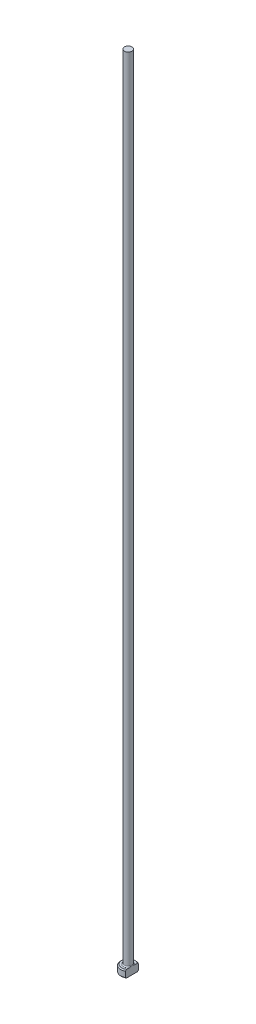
ISO-10303-21;
HEADER;
FILE_DESCRIPTION(('STEP AP214'),'2;1');
FILE_NAME('part.step','',(''),(''),'','','');
FILE_SCHEMA(('AUTOMOTIVE_DESIGN { 1 0 10303 214 1 1 1 1 }'));
ENDSEC;
DATA;
#1=APPLICATION_CONTEXT('core data for automotive mechanical design processes');
#2=APPLICATION_PROTOCOL_DEFINITION('international standard','automotive_design',2000,#1);
#3=PRODUCT_CONTEXT('',#1,'mechanical');
#4=PRODUCT('Part','Part','',(#3));
#5=PRODUCT_RELATED_PRODUCT_CATEGORY('part','',(#4));
#6=PRODUCT_DEFINITION_FORMATION('','',#4);
#7=PRODUCT_DEFINITION_CONTEXT('part definition',#1,'design');
#8=PRODUCT_DEFINITION('design','',#6,#7);
#9=PRODUCT_DEFINITION_SHAPE('','',#8);
#10=(LENGTH_UNIT() NAMED_UNIT(*) SI_UNIT(.MILLI.,.METRE.));
#11=(NAMED_UNIT(*) PLANE_ANGLE_UNIT() SI_UNIT($,.RADIAN.));
#12=(NAMED_UNIT(*) SI_UNIT($,.STERADIAN.) SOLID_ANGLE_UNIT());
#13=UNCERTAINTY_MEASURE_WITH_UNIT(LENGTH_MEASURE(1.E-05),#10,'distance_accuracy_value','');
#14=(GEOMETRIC_REPRESENTATION_CONTEXT(3) GLOBAL_UNCERTAINTY_ASSIGNED_CONTEXT((#13)) GLOBAL_UNIT_ASSIGNED_CONTEXT((#10,
#11,#12)) REPRESENTATION_CONTEXT('',''));
#15=CARTESIAN_POINT('',(0.,0.,0.));
#16=DIRECTION('',(0.,0.,1.));
#17=DIRECTION('',(1.,0.,0.));
#18=AXIS2_PLACEMENT_3D('',#15,#16,#17);
#19=CARTESIAN_POINT('',(0.,0.,0.));
#20=DIRECTION('',(0.,-1.,0.));
#21=DIRECTION('',(0.,0.,-1.));
#22=AXIS2_PLACEMENT_3D('',#19,#20,#21);
#23=PLANE('',#22);
#24=CARTESIAN_POINT('',(0.,0.,0.));
#25=DIRECTION('',(0.,-1.,0.));
#26=DIRECTION('',(0.,0.,-1.));
#27=AXIS2_PLACEMENT_3D('',#24,#25,#26);
#28=CIRCLE('',#27,1.29999999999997);
#29=CARTESIAN_POINT('',(0.749999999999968,0.,1.06183802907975));
#30=VERTEX_POINT('',#29);
#31=CARTESIAN_POINT('',(0.749999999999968,0.,-1.06183802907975));
#32=VERTEX_POINT('',#31);
#33=EDGE_CURVE('E98',#30,#32,#28,.T.);
#34=ORIENTED_EDGE('',*,*,#33,.T.);
#35=DIRECTION('',(0.,0.,1.));
#36=VECTOR('',#35,1.);
#37=CARTESIAN_POINT('',(0.749999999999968,0.,-1.29903810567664));
#38=LINE('',#37,#36);
#39=EDGE_CURVE('E83',#32,#30,#38,.T.);
#40=ORIENTED_EDGE('',*,*,#39,.T.);
#41=EDGE_LOOP('',(#34,#40));
#42=FACE_BOUND('',#41,.T.);
#43=ADVANCED_FACE('F32',(#42),#23,.T.);
#44=CARTESIAN_POINT('',(0.,259.958771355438,0.));
#45=DIRECTION('',(0.,1.,0.));
#46=DIRECTION('',(0.,0.,1.));
#47=AXIS2_PLACEMENT_3D('',#44,#45,#46);
#48=CYLINDRICAL_SURFACE('',#47,1.49999999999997);
#49=CARTESIAN_POINT('',(0.,1.30000000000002,0.));
#50=DIRECTION('',(0.,1.,0.));
#51=DIRECTION('',(0.,0.,1.));
#52=AXIS2_PLACEMENT_3D('',#49,#50,#51);
#53=CIRCLE('',#52,1.49999999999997);
#54=CARTESIAN_POINT('',(0.749999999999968,1.30000000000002,1.29903810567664));
#55=VERTEX_POINT('',#54);
#56=CARTESIAN_POINT('',(0.749999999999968,1.30000000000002,-1.29903810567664));
#57=VERTEX_POINT('',#56);
#58=EDGE_CURVE('E104',#55,#57,#53,.F.);
#59=ORIENTED_EDGE('',*,*,#58,.T.);
#60=DIRECTION('',(0.,-1.,0.));
#61=VECTOR('',#60,1.);
#62=CARTESIAN_POINT('',(0.749999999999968,160.,-1.29903810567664));
#63=LINE('',#62,#61);
#64=CARTESIAN_POINT('',(0.749999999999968,0.200000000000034,-1.29903810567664));
#65=VERTEX_POINT('',#64);
#66=EDGE_CURVE('E183',#57,#65,#63,.T.);
#67=ORIENTED_EDGE('',*,*,#66,.T.);
#68=CARTESIAN_POINT('',(0.,0.200000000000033,0.));
#69=DIRECTION('',(0.,-1.,0.));
#70=DIRECTION('',(0.,0.,-1.));
#71=AXIS2_PLACEMENT_3D('',#68,#69,#70);
#72=CIRCLE('',#71,1.49999999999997);
#73=CARTESIAN_POINT('',(0.749999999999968,0.200000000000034,1.29903810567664));
#74=VERTEX_POINT('',#73);
#75=EDGE_CURVE('E100',#65,#74,#72,.F.);
#76=ORIENTED_EDGE('',*,*,#75,.T.);
#77=DIRECTION('',(0.,-1.,0.));
#78=VECTOR('',#77,1.);
#79=CARTESIAN_POINT('',(0.749999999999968,160.,1.29903810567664));
#80=LINE('',#79,#78);
#81=EDGE_CURVE('E93',#55,#74,#80,.T.);
#82=ORIENTED_EDGE('',*,*,#81,.F.);
#83=EDGE_LOOP('',(#59,#67,#76,#82));
#84=FACE_BOUND('',#83,.T.);
#85=ADVANCED_FACE('F158',(#84),#48,.T.);
#86=CARTESIAN_POINT('',(-1.49999999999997,1.5,0.));
#87=DIRECTION('',(0.,1.,0.));
#88=DIRECTION('',(0.,0.,1.));
#89=AXIS2_PLACEMENT_3D('',#86,#87,#88);
#90=PLANE('',#89);
#91=CARTESIAN_POINT('',(0.,1.5,0.));
#92=DIRECTION('',(0.,1.,0.));
#93=DIRECTION('',(0.,0.,1.));
#94=AXIS2_PLACEMENT_3D('',#91,#92,#93);
#95=CIRCLE('',#94,1.29999999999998);
#96=CARTESIAN_POINT('',(0.749999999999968,1.5,-1.06183802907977));
#97=VERTEX_POINT('',#96);
#98=CARTESIAN_POINT('',(0.749999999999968,1.5,1.06183802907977));
#99=VERTEX_POINT('',#98);
#100=EDGE_CURVE('E178',#97,#99,#95,.T.);
#101=ORIENTED_EDGE('',*,*,#100,.T.);
#102=DIRECTION('',(0.,0.,-1.));
#103=VECTOR('',#102,1.);
#104=CARTESIAN_POINT('',(0.749999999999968,1.5,0.));
#105=LINE('',#104,#103);
#106=CARTESIAN_POINT('',(0.749999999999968,1.49999999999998,0.583095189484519));
#107=VERTEX_POINT('',#106);
#108=EDGE_CURVE('E57',#99,#107,#105,.T.);
#109=ORIENTED_EDGE('',*,*,#108,.T.);
#110=CARTESIAN_POINT('',(0.,1.5,0.));
#111=DIRECTION('',(0.,1.,0.));
#112=DIRECTION('',(0.,0.,1.));
#113=AXIS2_PLACEMENT_3D('',#110,#111,#112);
#114=CIRCLE('',#113,0.949999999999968);
#115=CARTESIAN_POINT('',(0.749999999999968,1.49999999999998,-0.583095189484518));
#116=VERTEX_POINT('',#115);
#117=EDGE_CURVE('E107',#107,#116,#114,.F.);
#118=ORIENTED_EDGE('',*,*,#117,.T.);
#119=EDGE_CURVE('E136',#116,#97,#105,.T.);
#120=ORIENTED_EDGE('',*,*,#119,.T.);
#121=EDGE_LOOP('',(#101,#109,#118,#120));
#122=FACE_BOUND('',#121,.T.);
#123=ADVANCED_FACE('F147',(#122),#90,.T.);
#124=CARTESIAN_POINT('',(0.,1.5,0.));
#125=DIRECTION('',(0.,-1.,0.));
#126=DIRECTION('',(0.,0.,-1.));
#127=AXIS2_PLACEMENT_3D('',#124,#125,#126);
#128=CONICAL_SURFACE('',#127,1.29999999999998,0.785398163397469);
#129=ORIENTED_EDGE('',*,*,#58,.F.);
#130=CARTESIAN_POINT('',(0.749999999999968,-0.159311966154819,2.86269581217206));
#131=CARTESIAN_POINT('',(0.749999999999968,-0.0964328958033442,2.79769204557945));
#132=CARTESIAN_POINT('',(0.749999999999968,-0.0336221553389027,2.73262201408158));
#133=CARTESIAN_POINT('',(0.749999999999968,0.0918244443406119,2.60231208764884));
#134=CARTESIAN_POINT('',(0.749999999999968,0.154460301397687,2.53707219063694));
#135=CARTESIAN_POINT('',(0.749999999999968,0.342109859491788,2.34097725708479));
#136=CARTESIAN_POINT('',(0.749999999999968,0.466801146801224,2.20981339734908));
#137=CARTESIAN_POINT('',(0.749999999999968,0.71232849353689,1.94880342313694));
#138=CARTESIAN_POINT('',(0.749999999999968,0.833191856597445,1.81898315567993));
#139=CARTESIAN_POINT('',(0.749999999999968,1.01264761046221,1.62259577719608));
#140=CARTESIAN_POINT('',(0.749999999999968,1.07215326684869,1.55686440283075));
#141=CARTESIAN_POINT('',(0.749999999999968,1.19029260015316,1.42462307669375));
#142=CARTESIAN_POINT('',(0.749999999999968,1.24892630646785,1.35811315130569));
#143=CARTESIAN_POINT('',(0.749999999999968,1.34237202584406,1.25003987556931));
#144=CARTESIAN_POINT('',(0.749999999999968,1.37758720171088,1.20882554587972));
#145=CARTESIAN_POINT('',(0.749999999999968,1.44738925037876,1.12585980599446));
#146=CARTESIAN_POINT('',(0.749999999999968,1.481976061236,1.08410834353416));
#147=CARTESIAN_POINT('',(0.749999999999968,1.55066668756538,0.999475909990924));
#148=CARTESIAN_POINT('',(0.749999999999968,1.58476158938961,0.956587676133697));
#149=CARTESIAN_POINT('',(0.749999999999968,1.65176028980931,0.869892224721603));
#150=CARTESIAN_POINT('',(0.749999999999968,1.6846642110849,0.826085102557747));
#151=CARTESIAN_POINT('',(0.749999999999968,1.74926316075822,0.736563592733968));
#152=CARTESIAN_POINT('',(0.749999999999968,1.78093229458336,0.690830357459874));
#153=CARTESIAN_POINT('',(0.749999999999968,1.84170221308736,0.597569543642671));
#154=CARTESIAN_POINT('',(0.749999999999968,1.87079946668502,0.550039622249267));
#155=CARTESIAN_POINT('',(0.749999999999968,1.9245841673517,0.45327502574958));
#156=CARTESIAN_POINT('',(0.749999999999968,1.94932190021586,0.404068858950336));
#157=CARTESIAN_POINT('',(0.749999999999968,1.9924017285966,0.302953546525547));
#158=CARTESIAN_POINT('',(0.749999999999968,2.01076529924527,0.251054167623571));
#159=CARTESIAN_POINT('',(0.749999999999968,2.03062801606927,0.173219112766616));
#160=CARTESIAN_POINT('',(0.749999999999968,2.03589389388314,0.148243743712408));
#161=CARTESIAN_POINT('',(0.749999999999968,2.04404463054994,0.0979002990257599));
#162=CARTESIAN_POINT('',(0.749999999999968,2.04692969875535,0.0725322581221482));
#163=CARTESIAN_POINT('',(0.749999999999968,2.05011277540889,0.0217085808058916));
#164=CARTESIAN_POINT('',(0.749999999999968,2.05041870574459,-0.00374654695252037));
#165=CARTESIAN_POINT('',(0.749999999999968,2.04844884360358,-0.0545512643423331));
#166=CARTESIAN_POINT('',(0.749999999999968,2.046172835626,-0.0799008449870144));
#167=CARTESIAN_POINT('',(0.749999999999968,2.03574038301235,-0.154989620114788));
#168=CARTESIAN_POINT('',(0.749999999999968,2.02400532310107,-0.204255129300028));
#169=CARTESIAN_POINT('',(0.749999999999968,2.00101199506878,-0.276434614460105));
#170=CARTESIAN_POINT('',(0.749999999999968,1.99241146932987,-0.3002842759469));
#171=CARTESIAN_POINT('',(0.749999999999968,1.97373056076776,-0.347397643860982));
#172=CARTESIAN_POINT('',(0.749999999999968,1.96365048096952,-0.370661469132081));
#173=CARTESIAN_POINT('',(0.749999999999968,1.93147369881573,-0.43991644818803));
#174=CARTESIAN_POINT('',(0.749999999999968,1.90754987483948,-0.485052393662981));
#175=CARTESIAN_POINT('',(0.749999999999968,1.856538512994,-0.57351807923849));
#176=CARTESIAN_POINT('',(0.749999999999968,1.82944709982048,-0.616845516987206));
#177=CARTESIAN_POINT('',(0.749999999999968,1.7730528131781,-0.70224758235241));
#178=CARTESIAN_POINT('',(0.749999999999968,1.74374234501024,-0.744317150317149));
#179=CARTESIAN_POINT('',(0.749999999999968,1.68364081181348,-0.82739018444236));
#180=CARTESIAN_POINT('',(0.749999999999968,1.65284939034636,-0.868393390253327));
#181=CARTESIAN_POINT('',(0.749999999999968,1.55811585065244,-0.991236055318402));
#182=CARTESIAN_POINT('',(0.749999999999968,1.49256261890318,-1.07182756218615));
#183=CARTESIAN_POINT('',(0.749999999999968,1.35929153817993,-1.23084604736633));
#184=CARTESIAN_POINT('',(0.749999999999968,1.29157909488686,-1.30927763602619));
#185=CARTESIAN_POINT('',(0.749999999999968,1.16634991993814,-1.4516373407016));
#186=CARTESIAN_POINT('',(0.749999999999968,1.10905780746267,-1.51576342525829));
#187=CARTESIAN_POINT('',(0.749999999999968,0.993771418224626,-1.64338257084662));
#188=CARTESIAN_POINT('',(0.749999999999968,0.935777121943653,-1.70687561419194));
#189=CARTESIAN_POINT('',(0.749999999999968,0.760930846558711,-1.8967787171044));
#190=CARTESIAN_POINT('',(0.749999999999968,0.6433230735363,-2.02249209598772));
#191=CARTESIAN_POINT('',(0.749999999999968,0.411828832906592,-2.26768837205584));
#192=CARTESIAN_POINT('',(0.749999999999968,0.29798827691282,-2.38721485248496));
#193=CARTESIAN_POINT('',(0.749999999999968,0.0697231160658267,-2.62545352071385));
#194=CARTESIAN_POINT('',(0.749999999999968,-0.0447006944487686,-2.74416646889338));
#195=CARTESIAN_POINT('',(0.749999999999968,-0.159311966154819,-2.86269581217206));
#196=B_SPLINE_CURVE_WITH_KNOTS('',3,(#130,#131,#132,#133,#134,#135,#136,#137,#138,#139,#140,
#141,#142,#143,#144,#145,#146,#147,#148,#149,#150,#151,#152,#153,#154,#155,#156,#157,#158,#159,
#160,#161,#162,#163,#164,#165,#166,#167,#168,#169,#170,#171,#172,#173,#174,#175,#176,#177,#178,
#179,#180,#181,#182,#183,#184,#185,#186,#187,#188,#189,#190,#191,#192,#193,#194,#195),
.UNSPECIFIED.,.F.,.F.,(4,2,2,2,2,2,2,2,2,2,2,2,2,2,2,2,2,2,2,2,2,2,2,2,2,2,2,2,2,2,2,2,4),(0.,
0.271318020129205,0.542639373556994,1.08555961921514,1.61765797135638,1.8836492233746,
2.14963148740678,2.31225703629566,2.47489853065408,2.63925165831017,2.80358780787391,
2.97041571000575,3.13746921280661,3.30244771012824,3.46686485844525,3.54334114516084,
3.61981070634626,3.6960453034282,3.77228626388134,3.92333298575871,3.9993629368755,
4.07537733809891,4.22841106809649,4.38163402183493,4.53540740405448,4.68921798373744,
5.00077730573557,5.31160990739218,5.56957672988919,5.82755073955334,6.34398366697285,
6.83917444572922,7.33381214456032),.UNSPECIFIED.);
#197=EDGE_CURVE('E135',#55,#99,#196,.T.);
#198=ORIENTED_EDGE('',*,*,#197,.T.);
#199=ORIENTED_EDGE('',*,*,#100,.F.);
#200=EDGE_CURVE('E127',#97,#57,#196,.T.);
#201=ORIENTED_EDGE('',*,*,#200,.T.);
#202=EDGE_LOOP('',(#129,#198,#199,#201));
#203=FACE_BOUND('',#202,.T.);
#204=ADVANCED_FACE('F143',(#203),#128,.T.);
#205=CARTESIAN_POINT('',(0.,0.200000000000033,0.));
#206=DIRECTION('',(0.,1.,0.));
#207=DIRECTION('',(0.,0.,1.));
#208=AXIS2_PLACEMENT_3D('',#205,#206,#207);
#209=CONICAL_SURFACE('',#208,1.49999999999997,0.785398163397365);
#210=ORIENTED_EDGE('',*,*,#75,.F.);
#211=CARTESIAN_POINT('',(0.749999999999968,1.65931196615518,-2.86269581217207));
#212=CARTESIAN_POINT('',(0.749999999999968,1.59643289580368,-2.79769204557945));
#213=CARTESIAN_POINT('',(0.749999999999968,1.53362215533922,-2.73262201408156));
#214=CARTESIAN_POINT('',(0.749999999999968,1.40817555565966,-2.60231208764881));
#215=CARTESIAN_POINT('',(0.749999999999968,1.34553969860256,-2.53707219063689));
#216=CARTESIAN_POINT('',(0.749999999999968,1.15789014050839,-2.34097725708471));
#217=CARTESIAN_POINT('',(0.749999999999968,1.03319885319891,-2.20981339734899));
#218=CARTESIAN_POINT('',(0.749999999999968,0.787671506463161,-1.9488034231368));
#219=CARTESIAN_POINT('',(0.749999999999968,0.666808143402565,-1.81898315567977));
#220=CARTESIAN_POINT('',(0.749999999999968,0.487352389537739,-1.6225957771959));
#221=CARTESIAN_POINT('',(0.749999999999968,0.427846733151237,-1.55686440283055));
#222=CARTESIAN_POINT('',(0.749999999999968,0.309707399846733,-1.42462307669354));
#223=CARTESIAN_POINT('',(0.749999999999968,0.251073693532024,-1.35811315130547));
#224=CARTESIAN_POINT('',(0.749999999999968,0.157627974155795,-1.25003987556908));
#225=CARTESIAN_POINT('',(0.749999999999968,0.122412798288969,-1.2088255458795));
#226=CARTESIAN_POINT('',(0.749999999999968,0.0526107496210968,-1.12585980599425));
#227=CARTESIAN_POINT('',(0.749999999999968,0.0180239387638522,-1.08410834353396));
#228=CARTESIAN_POINT('',(0.749999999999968,-0.0506666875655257,-0.999475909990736));
#229=CARTESIAN_POINT('',(0.749999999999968,-0.0847615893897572,-0.956587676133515));
#230=CARTESIAN_POINT('',(0.749999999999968,-0.151760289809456,-0.869892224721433));
#231=CARTESIAN_POINT('',(0.749999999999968,-0.184664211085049,-0.826085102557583));
#232=CARTESIAN_POINT('',(0.749999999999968,-0.249263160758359,-0.736563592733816));
#233=CARTESIAN_POINT('',(0.749999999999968,-0.280932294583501,-0.690830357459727));
#234=CARTESIAN_POINT('',(0.749999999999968,-0.3417022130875,-0.597569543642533));
#235=CARTESIAN_POINT('',(0.749999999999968,-0.370799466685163,-0.550039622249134));
#236=CARTESIAN_POINT('',(0.749999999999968,-0.424584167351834,-0.453275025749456));
#237=CARTESIAN_POINT('',(0.749999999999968,-0.449321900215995,-0.404068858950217));
#238=CARTESIAN_POINT('',(0.749999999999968,-0.492401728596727,-0.302953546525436));
#239=CARTESIAN_POINT('',(0.749999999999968,-0.510765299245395,-0.251054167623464));
#240=CARTESIAN_POINT('',(0.749999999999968,-0.530628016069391,-0.173219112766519));
#241=CARTESIAN_POINT('',(0.749999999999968,-0.535893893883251,-0.148243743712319));
#242=CARTESIAN_POINT('',(0.749999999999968,-0.544044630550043,-0.0979002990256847));
#243=CARTESIAN_POINT('',(0.749999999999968,-0.546929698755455,-0.07253225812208));
#244=CARTESIAN_POINT('',(0.749999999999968,-0.550112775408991,-0.0217085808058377));
#245=CARTESIAN_POINT('',(0.749999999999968,-0.550418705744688,0.0037465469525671));
#246=CARTESIAN_POINT('',(0.749999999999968,-0.54844884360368,0.0545512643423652));
#247=CARTESIAN_POINT('',(0.749999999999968,-0.546172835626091,0.0799008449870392));
#248=CARTESIAN_POINT('',(0.749999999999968,-0.535740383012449,0.15498962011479));
#249=CARTESIAN_POINT('',(0.749999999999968,-0.524005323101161,0.204255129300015));
#250=CARTESIAN_POINT('',(0.749999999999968,-0.50101199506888,0.276434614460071));
#251=CARTESIAN_POINT('',(0.749999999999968,-0.49241146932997,0.300284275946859));
#252=CARTESIAN_POINT('',(0.749999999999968,-0.473730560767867,0.347397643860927));
#253=CARTESIAN_POINT('',(0.749999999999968,-0.463650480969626,0.370661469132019));
#254=CARTESIAN_POINT('',(0.749999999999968,-0.431473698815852,0.439916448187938));
#255=CARTESIAN_POINT('',(0.749999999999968,-0.407549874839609,0.485052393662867));
#256=CARTESIAN_POINT('',(0.749999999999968,-0.356538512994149,0.573518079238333));
#257=CARTESIAN_POINT('',(0.749999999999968,-0.329447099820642,0.616845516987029));
#258=CARTESIAN_POINT('',(0.749999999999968,-0.273052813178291,0.702247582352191));
#259=CARTESIAN_POINT('',(0.749999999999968,-0.243742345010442,0.744317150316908));
#260=CARTESIAN_POINT('',(0.749999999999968,-0.183640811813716,0.827390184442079));
#261=CARTESIAN_POINT('',(0.749999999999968,-0.152849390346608,0.868393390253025));
#262=CARTESIAN_POINT('',(0.749999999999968,-0.0581158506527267,0.99123605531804));
#263=CARTESIAN_POINT('',(0.749999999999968,0.00743738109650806,1.07182756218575));
#264=CARTESIAN_POINT('',(0.749999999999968,0.140708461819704,1.23084604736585));
#265=CARTESIAN_POINT('',(0.749999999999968,0.208420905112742,1.30927763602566));
#266=CARTESIAN_POINT('',(0.749999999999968,0.333650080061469,1.45163734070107));
#267=CARTESIAN_POINT('',(0.749999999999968,0.390942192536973,1.51576342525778));
#268=CARTESIAN_POINT('',(0.749999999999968,0.506228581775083,1.64338257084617));
#269=CARTESIAN_POINT('',(0.749999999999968,0.56422287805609,1.70687561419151));
#270=CARTESIAN_POINT('',(0.749999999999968,0.739069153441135,1.89677871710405));
#271=CARTESIAN_POINT('',(0.749999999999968,0.856676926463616,2.02249209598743));
#272=CARTESIAN_POINT('',(0.749999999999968,1.08817116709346,2.26768837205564));
#273=CARTESIAN_POINT('',(0.749999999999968,1.20201172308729,2.3872148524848));
#274=CARTESIAN_POINT('',(0.749999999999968,1.43027688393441,2.62545352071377));
#275=CARTESIAN_POINT('',(0.749999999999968,1.54470069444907,2.74416646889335));
#276=CARTESIAN_POINT('',(0.749999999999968,1.65931196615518,2.86269581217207));
#277=B_SPLINE_CURVE_WITH_KNOTS('',3,(#211,#212,#213,#214,#215,#216,#217,#218,#219,#220,#221,
#222,#223,#224,#225,#226,#227,#228,#229,#230,#231,#232,#233,#234,#235,#236,#237,#238,#239,#240,
#241,#242,#243,#244,#245,#246,#247,#248,#249,#250,#251,#252,#253,#254,#255,#256,#257,#258,#259,
#260,#261,#262,#263,#264,#265,#266,#267,#268,#269,#270,#271,#272,#273,#274,#275,#276),
.UNSPECIFIED.,.F.,.F.,(4,2,2,2,2,2,2,2,2,2,2,2,2,2,2,2,2,2,2,2,2,2,2,2,2,2,2,2,2,2,2,2,4),(0.,
0.271318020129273,0.542639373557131,1.08555961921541,1.61765797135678,1.88364922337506,
2.1496314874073,2.31225703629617,2.47489853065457,2.63925165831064,2.80358780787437,
2.9704157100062,3.13746921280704,3.30244771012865,3.46686485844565,3.54334114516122,
3.61981070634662,3.69604530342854,3.77228626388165,3.92333298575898,3.99936293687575,
4.07537733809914,4.22841106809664,4.38163402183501,4.53540740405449,4.68921798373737,
5.00077730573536,5.31160990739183,5.56957672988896,5.82755073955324,6.34398366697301,
6.83917444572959,7.33381214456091),.UNSPECIFIED.);
#278=EDGE_CURVE('E86',#65,#32,#277,.T.);
#279=ORIENTED_EDGE('',*,*,#278,.T.);
#280=ORIENTED_EDGE('',*,*,#33,.F.);
#281=EDGE_CURVE('E89',#30,#74,#277,.T.);
#282=ORIENTED_EDGE('',*,*,#281,.T.);
#283=EDGE_LOOP('',(#210,#279,#280,#282));
#284=FACE_BOUND('',#283,.T.);
#285=ADVANCED_FACE('F97',(#284),#209,.T.);
#286=CARTESIAN_POINT('',(0.,1.69999999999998,0.));
#287=DIRECTION('',(0.,1.,0.));
#288=DIRECTION('',(0.,0.,1.));
#289=AXIS2_PLACEMENT_3D('',#286,#287,#288);
#290=TOROIDAL_SURFACE('',#289,0.949999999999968,0.2);
#291=CARTESIAN_POINT('',(0.749999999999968,1.69999999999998,0.));
#292=CARTESIAN_POINT('',(0.749999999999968,1.70000052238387,0.));
#293=CARTESIAN_POINT('',(0.749999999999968,1.70000104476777,-7.92518426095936E-08));
#294=CARTESIAN_POINT('',(0.749999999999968,1.70000206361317,-3.45345029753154E-07));
#295=CARTESIAN_POINT('',(0.749999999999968,1.70000255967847,-5.3349315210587E-07));
#296=CARTESIAN_POINT('',(0.749999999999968,1.70000354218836,-9.91557921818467E-07));
#297=CARTESIAN_POINT('',(0.749999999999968,1.70000402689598,-1.26510931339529E-06));
#298=CARTESIAN_POINT('',(0.749999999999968,1.70000495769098,-1.86638896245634E-06));
#299=CARTESIAN_POINT('',(0.749999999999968,1.70000540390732,-2.19392466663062E-06));
#300=CARTESIAN_POINT('',(0.749999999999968,1.70000683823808,-3.33370952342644E-06));
#301=CARTESIAN_POINT('',(0.749999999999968,1.70000776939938,-4.21820142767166E-06));
#302=CARTESIAN_POINT('',(0.749999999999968,1.70000948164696,-6.08403165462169E-06));
#303=CARTESIAN_POINT('',(0.749999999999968,1.70001026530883,-7.06314143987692E-06));
#304=CARTESIAN_POINT('',(0.749999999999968,1.70001305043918,-1.07283299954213E-05));
#305=CARTESIAN_POINT('',(0.749999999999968,1.70001489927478,-1.35334970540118E-05));
#306=CARTESIAN_POINT('',(0.749999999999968,1.70001806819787,-1.91887701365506E-05));
#307=CARTESIAN_POINT('',(0.749999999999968,1.70001941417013,-2.20250297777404E-05));
#308=CARTESIAN_POINT('',(0.749999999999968,1.700024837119,-3.36357626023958E-05));
#309=CARTESIAN_POINT('',(0.749999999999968,1.70002876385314,-4.24755661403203E-05));
#310=CARTESIAN_POINT('',(0.749999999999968,1.70003535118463,-5.93015818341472E-05));
#311=CARTESIAN_POINT('',(0.749999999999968,1.70003811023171,-6.72480836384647E-05));
#312=CARTESIAN_POINT('',(0.749999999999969,1.70005910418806,-0.000122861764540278));
#313=CARTESIAN_POINT('',(0.749999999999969,1.7000847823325,-0.000167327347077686));
#314=CARTESIAN_POINT('',(0.749999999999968,1.70017912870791,-0.000337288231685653));
#315=CARTESIAN_POINT('',(0.749999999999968,1.70024226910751,-0.000465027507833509));
#316=CARTESIAN_POINT('',(0.749999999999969,1.70048606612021,-0.000950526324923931));
#317=CARTESIAN_POINT('',(0.749999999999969,1.70067249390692,-0.00130597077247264));
#318=CARTESIAN_POINT('',(0.749999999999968,1.70141452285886,-0.00272815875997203));
#319=CARTESIAN_POINT('',(0.749999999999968,1.70196367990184,-0.00379745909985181));
#320=CARTESIAN_POINT('',(0.749999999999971,1.71079317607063,-0.0209810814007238));
#321=CARTESIAN_POINT('',(0.749999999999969,1.71912708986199,-0.0370747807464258));
#322=CARTESIAN_POINT('',(0.749999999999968,1.7353816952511,-0.068794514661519));
#323=CARTESIAN_POINT('',(0.749999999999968,1.74330692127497,-0.0844183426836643));
#324=CARTESIAN_POINT('',(0.749999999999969,1.75980152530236,-0.11741223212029));
#325=CARTESIAN_POINT('',(0.749999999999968,1.76835063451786,-0.134792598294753));
#326=CARTESIAN_POINT('',(0.749999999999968,1.7851625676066,-0.169887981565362));
#327=CARTESIAN_POINT('',(0.749999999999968,1.79342203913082,-0.187604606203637));
#328=CARTESIAN_POINT('',(0.749999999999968,1.81367684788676,-0.232718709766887));
#329=CARTESIAN_POINT('',(0.749999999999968,1.82533268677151,-0.260271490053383));
#330=CARTESIAN_POINT('',(0.749999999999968,1.84666110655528,-0.315501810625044));
#331=CARTESIAN_POINT('',(0.749999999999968,1.85636938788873,-0.34316526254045));
#332=CARTESIAN_POINT('',(0.749999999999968,1.87268127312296,-0.396748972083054));
#333=CARTESIAN_POINT('',(0.749999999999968,1.87948325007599,-0.42260763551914));
#334=CARTESIAN_POINT('',(0.749999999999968,1.89076706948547,-0.476103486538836));
#335=CARTESIAN_POINT('',(0.749999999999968,1.89512718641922,-0.50376764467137));
#336=CARTESIAN_POINT('',(0.749999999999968,1.90012258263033,-0.559350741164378));
#337=CARTESIAN_POINT('',(0.749999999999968,1.90077276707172,-0.587268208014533));
#338=CARTESIAN_POINT('',(0.749999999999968,1.8972553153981,-0.64249646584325));
#339=CARTESIAN_POINT('',(0.749999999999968,1.89315871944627,-0.669810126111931));
#340=CARTESIAN_POINT('',(0.749999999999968,1.88226759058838,-0.710376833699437));
#341=CARTESIAN_POINT('',(0.749999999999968,1.87764112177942,-0.724213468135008));
#342=CARTESIAN_POINT('',(0.749999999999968,1.8664543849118,-0.751128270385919));
#343=CARTESIAN_POINT('',(0.749999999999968,1.85989169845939,-0.764205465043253));
#344=CARTESIAN_POINT('',(0.749999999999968,1.84591711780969,-0.787020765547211));
#345=CARTESIAN_POINT('',(0.749999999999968,1.83882518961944,-0.796953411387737));
#346=CARTESIAN_POINT('',(0.749999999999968,1.82312129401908,-0.815534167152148));
#347=CARTESIAN_POINT('',(0.749999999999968,1.81451194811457,-0.824184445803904));
#348=CARTESIAN_POINT('',(0.749999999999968,1.79770708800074,-0.838172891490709));
#349=CARTESIAN_POINT('',(0.749999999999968,1.78977561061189,-0.84382734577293));
#350=CARTESIAN_POINT('',(0.749999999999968,1.77308433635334,-0.853755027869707));
#351=CARTESIAN_POINT('',(0.749999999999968,1.76432487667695,-0.858028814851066));
#352=CARTESIAN_POINT('',(0.749999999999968,1.74611994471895,-0.864966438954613));
#353=CARTESIAN_POINT('',(0.749999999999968,1.73667052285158,-0.867620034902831));
#354=CARTESIAN_POINT('',(0.749999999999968,1.71743927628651,-0.871086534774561));
#355=CARTESIAN_POINT('',(0.749999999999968,1.70765762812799,-0.871900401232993));
#356=CARTESIAN_POINT('',(0.749999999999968,1.68916476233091,-0.871644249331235));
#357=CARTESIAN_POINT('',(0.749999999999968,1.68045031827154,-0.870765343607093));
#358=CARTESIAN_POINT('',(0.749999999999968,1.66329782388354,-0.867547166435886));
#359=CARTESIAN_POINT('',(0.749999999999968,1.65485975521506,-0.865207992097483));
#360=CARTESIAN_POINT('',(0.749999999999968,1.63851016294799,-0.859212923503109));
#361=CARTESIAN_POINT('',(0.749999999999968,1.63059660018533,-0.855562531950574));
#362=CARTESIAN_POINT('',(0.749999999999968,1.61540880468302,-0.847119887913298));
#363=CARTESIAN_POINT('',(0.749999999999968,1.60813470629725,-0.842327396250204));
#364=CARTESIAN_POINT('',(0.749999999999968,1.59350795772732,-0.831172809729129));
#365=CARTESIAN_POINT('',(0.749999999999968,1.58624574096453,-0.82469266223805));
#366=CARTESIAN_POINT('',(0.749999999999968,1.57268239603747,-0.810794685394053));
#367=CARTESIAN_POINT('',(0.749999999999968,1.56638225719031,-0.803375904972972));
#368=CARTESIAN_POINT('',(0.749999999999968,1.55147186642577,-0.783446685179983));
#369=CARTESIAN_POINT('',(0.749999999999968,1.54355238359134,-0.770417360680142));
#370=CARTESIAN_POINT('',(0.749999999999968,1.52991429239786,-0.743286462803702));
#371=CARTESIAN_POINT('',(0.749999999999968,1.52419651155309,-0.729184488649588));
#372=CARTESIAN_POINT('',(0.749999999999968,1.51257018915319,-0.693822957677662));
#373=CARTESIAN_POINT('',(0.749999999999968,1.50774380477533,-0.672209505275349));
#374=CARTESIAN_POINT('',(0.749999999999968,1.50145191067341,-0.628298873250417));
#375=CARTESIAN_POINT('',(0.749999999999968,1.5000267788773,-0.605996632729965));
#376=CARTESIAN_POINT('',(0.749999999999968,1.49995578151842,-0.546111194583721));
#377=CARTESIAN_POINT('',(0.749999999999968,1.50388309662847,-0.508527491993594));
#378=CARTESIAN_POINT('',(0.749999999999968,1.51373246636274,-0.453837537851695));
#379=CARTESIAN_POINT('',(0.749999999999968,1.51754666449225,-0.436272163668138));
#380=CARTESIAN_POINT('',(0.749999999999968,1.52621031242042,-0.401484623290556));
#381=CARTESIAN_POINT('',(0.749999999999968,1.53105449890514,-0.384261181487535));
#382=CARTESIAN_POINT('',(0.749999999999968,1.54486296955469,-0.339542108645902));
#383=CARTESIAN_POINT('',(0.749999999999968,1.55452531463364,-0.312264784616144));
#384=CARTESIAN_POINT('',(0.749999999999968,1.57570310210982,-0.257776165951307));
#385=CARTESIAN_POINT('',(0.749999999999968,1.58725400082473,-0.230578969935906));
#386=CARTESIAN_POINT('',(0.749999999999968,1.60733071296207,-0.18597536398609));
#387=CARTESIAN_POINT('',(0.749999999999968,1.6155301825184,-0.168419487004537));
#388=CARTESIAN_POINT('',(0.749999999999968,1.63221303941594,-0.133639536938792));
#389=CARTESIAN_POINT('',(0.749999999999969,1.64069316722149,-0.116413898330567));
#390=CARTESIAN_POINT('',(0.749999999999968,1.65705001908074,-0.0837133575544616));
#391=CARTESIAN_POINT('',(0.749999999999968,1.66490699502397,-0.0682284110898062));
#392=CARTESIAN_POINT('',(0.749999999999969,1.68101978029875,-0.0367899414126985));
#393=CARTESIAN_POINT('',(0.749999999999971,1.68928002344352,-0.0208385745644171));
#394=CARTESIAN_POINT('',(0.749999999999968,1.69803632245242,-0.00379745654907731));
#395=CARTESIAN_POINT('',(0.749999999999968,1.69858548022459,-0.00272815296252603));
#396=CARTESIAN_POINT('',(0.749999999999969,1.69932750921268,-0.00130596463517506));
#397=CARTESIAN_POINT('',(0.749999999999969,1.69951393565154,-0.000950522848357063));
#398=CARTESIAN_POINT('',(0.749999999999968,1.69975773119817,-0.000465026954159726));
#399=CARTESIAN_POINT('',(0.749999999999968,1.6998208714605,-0.000337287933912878));
#400=CARTESIAN_POINT('',(0.749999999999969,1.69991521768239,-0.00016732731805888));
#401=CARTESIAN_POINT('',(0.749999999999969,1.69994089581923,-0.000122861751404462));
#402=CARTESIAN_POINT('',(0.749999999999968,1.69996188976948,-6.72480869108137E-05));
#403=CARTESIAN_POINT('',(0.749999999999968,1.69996464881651,-5.93015849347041E-05));
#404=CARTESIAN_POINT('',(0.749999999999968,1.6999712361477,-4.24755687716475E-05));
#405=CARTESIAN_POINT('',(0.749999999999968,1.69997516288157,-3.36357649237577E-05));
#406=CARTESIAN_POINT('',(0.749999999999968,1.69998058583,-2.20250315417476E-05));
#407=CARTESIAN_POINT('',(0.749999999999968,1.69998193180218,-1.91887716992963E-05));
#408=CARTESIAN_POINT('',(0.749999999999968,1.69998510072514,-1.35334981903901E-05));
#409=CARTESIAN_POINT('',(0.749999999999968,1.69998694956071,-1.07283309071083E-05));
#410=CARTESIAN_POINT('',(0.749999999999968,1.69998973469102,-7.06314205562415E-06));
#411=CARTESIAN_POINT('',(0.749999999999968,1.69999051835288,-6.08403219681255E-06));
#412=CARTESIAN_POINT('',(0.749999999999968,1.69999223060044,-4.21820182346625E-06));
#413=CARTESIAN_POINT('',(0.749999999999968,1.69999316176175,-3.33370984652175E-06));
#414=CARTESIAN_POINT('',(0.749999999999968,1.69999459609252,-2.19392489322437E-06));
#415=CARTESIAN_POINT('',(0.749999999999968,1.69999504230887,-1.86638916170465E-06));
#416=CARTESIAN_POINT('',(0.749999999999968,1.69999597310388,-1.26510946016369E-06));
#417=CARTESIAN_POINT('',(0.749999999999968,1.69999645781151,-9.91558043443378E-07));
#418=CARTESIAN_POINT('',(0.749999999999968,1.69999744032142,-5.33493228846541E-07));
#419=CARTESIAN_POINT('',(0.749999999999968,1.69999793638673,-3.453450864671E-07));
#420=CARTESIAN_POINT('',(0.749999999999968,1.69999895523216,-7.92518654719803E-08));
#421=CARTESIAN_POINT('',(0.749999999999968,1.69999947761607,0.));
#422=CARTESIAN_POINT('',(0.749999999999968,1.69999999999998,0.));
#423=B_SPLINE_CURVE_WITH_KNOTS('',3,(#291,#292,#293,#294,#295,#296,#297,#298,#299,#300,#301,
#302,#303,#304,#305,#306,#307,#308,#309,#310,#311,#312,#313,#314,#315,#316,#317,#318,#319,#320,
#321,#322,#323,#324,#325,#326,#327,#328,#329,#330,#331,#332,#333,#334,#335,#336,#337,#338,#339,
#340,#341,#342,#343,#344,#345,#346,#347,#348,#349,#350,#351,#352,#353,#354,#355,#356,#357,#358,
#359,#360,#361,#362,#363,#364,#365,#366,#367,#368,#369,#370,#371,#372,#373,#374,#375,#376,#377,
#378,#379,#380,#381,#382,#383,#384,#385,#386,#387,#388,#389,#390,#391,#392,#393,#394,#395,#396,
#397,#398,#399,#400,#401,#402,#403,#404,#405,#406,#407,#408,#409,#410,#411,#412,#413,#414,#415,
#416,#417,#418,#419,#420,#421,#422),.UNSPECIFIED.,.T.,.F.,(4,2,2,2,2,2,2,2,2,2,2,2,2,2,2,2,2,2,
2,2,2,2,2,2,2,2,2,2,2,2,2,2,2,2,2,2,2,2,2,2,2,2,2,2,2,2,2,2,2,2,2,2,2,2,2,2,2,2,2,2,2,2,2,2,2,
4),(0.,1.56543920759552E-06,3.1500654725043E-06,4.81434344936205E-06,6.47280881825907E-06,
1.03067366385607E-05,1.4065794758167E-05,2.41046688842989E-05,3.35140857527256E-05,
6.25197196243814E-05,8.77289706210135E-05,0.000240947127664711,0.000669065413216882,
0.00187238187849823,0.00547938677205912,0.0598417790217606,0.112399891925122,0.170503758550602,
0.229141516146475,0.318850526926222,0.406723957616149,0.486842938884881,0.570663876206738,
0.654147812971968,0.736398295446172,0.780052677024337,0.823761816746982,0.860241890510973,
0.896659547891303,0.925764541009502,0.954857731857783,0.98413296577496,1.01339287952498,
1.03954157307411,1.06568852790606,1.09172701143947,1.11777095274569,1.14686281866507,
1.17598440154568,1.22146737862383,1.26696743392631,1.33303548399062,1.39988404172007,
1.51253340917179,1.56644503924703,1.62008752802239,1.70682485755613,1.79543193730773,
1.85355663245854,1.91115281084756,1.96324672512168,2.01712839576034,2.02073541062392,
2.02193871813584,2.02236683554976,2.02252005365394,2.02254526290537,2.02257426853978,
2.02258367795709,2.02259371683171,2.02259747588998,2.02260130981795,2.02260296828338,
2.02260463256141,2.02260621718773,2.02260778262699),.UNSPECIFIED.);
#424=CARTESIAN_POINT('',(0.749999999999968,1.69999999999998,0.));
#425=VERTEX_POINT('',#424);
#426=EDGE_CURVE('E11',#116,#425,#423,.T.);
#427=ORIENTED_EDGE('',*,*,#426,.F.);
#428=ORIENTED_EDGE('',*,*,#117,.F.);
#429=CARTESIAN_POINT('',(0.749999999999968,1.69999999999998,0.));
#430=CARTESIAN_POINT('',(0.749999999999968,1.69999947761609,0.));
#431=CARTESIAN_POINT('',(0.749999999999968,1.69999895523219,7.92518426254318E-08));
#432=CARTESIAN_POINT('',(0.749999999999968,1.69999793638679,3.45345029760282E-07));
#433=CARTESIAN_POINT('',(0.749999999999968,1.69999744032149,5.33493152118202E-07));
#434=CARTESIAN_POINT('',(0.749999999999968,1.6999964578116,9.91557921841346E-07));
#435=CARTESIAN_POINT('',(0.749999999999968,1.69999597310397,1.26510931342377E-06));
#436=CARTESIAN_POINT('',(0.749999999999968,1.69999504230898,1.86638896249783E-06));
#437=CARTESIAN_POINT('',(0.749999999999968,1.69999459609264,2.19392466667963E-06));
#438=CARTESIAN_POINT('',(0.749999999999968,1.69999316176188,3.33370952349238E-06));
#439=CARTESIAN_POINT('',(0.749999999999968,1.69999223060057,4.21820142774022E-06));
#440=CARTESIAN_POINT('',(0.749999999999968,1.699990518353,6.08403165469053E-06));
#441=CARTESIAN_POINT('',(0.749999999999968,1.69998973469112,7.06314143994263E-06));
#442=CARTESIAN_POINT('',(0.749999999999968,1.69998694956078,1.07283299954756E-05));
#443=CARTESIAN_POINT('',(0.749999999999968,1.69998510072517,1.35334970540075E-05));
#444=CARTESIAN_POINT('',(0.749999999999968,1.69998193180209,1.91887701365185E-05));
#445=CARTESIAN_POINT('',(0.749999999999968,1.69998058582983,2.20250297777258E-05));
#446=CARTESIAN_POINT('',(0.749999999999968,1.69997516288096,3.36357626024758E-05));
#447=CARTESIAN_POINT('',(0.749999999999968,1.69997123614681,4.24755661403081E-05));
#448=CARTESIAN_POINT('',(0.749999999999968,1.69996464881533,5.93015818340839E-05));
#449=CARTESIAN_POINT('',(0.749999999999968,1.69996188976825,6.72480836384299E-05));
#450=CARTESIAN_POINT('',(0.749999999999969,1.6999408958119,0.000122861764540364));
#451=CARTESIAN_POINT('',(0.749999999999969,1.69991521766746,0.00016732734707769));
#452=CARTESIAN_POINT('',(0.749999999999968,1.69982087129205,0.000337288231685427));
#453=CARTESIAN_POINT('',(0.749999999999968,1.69975773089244,0.000465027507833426));
#454=CARTESIAN_POINT('',(0.749999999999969,1.69951393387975,0.000950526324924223));
#455=CARTESIAN_POINT('',(0.749999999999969,1.69932750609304,0.00130597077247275));
#456=CARTESIAN_POINT('',(0.749999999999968,1.6985854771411,0.00272815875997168));
#457=CARTESIAN_POINT('',(0.749999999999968,1.69803632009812,0.00379745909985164));
#458=CARTESIAN_POINT('',(0.749999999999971,1.68920682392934,0.0209810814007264));
#459=CARTESIAN_POINT('',(0.749999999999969,1.68087291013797,0.0370747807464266));
#460=CARTESIAN_POINT('',(0.749999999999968,1.66461830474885,0.0687945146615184));
#461=CARTESIAN_POINT('',(0.749999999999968,1.65669307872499,0.0844183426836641));
#462=CARTESIAN_POINT('',(0.749999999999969,1.6401984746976,0.11741223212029));
#463=CARTESIAN_POINT('',(0.749999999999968,1.6316493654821,0.134792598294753));
#464=CARTESIAN_POINT('',(0.749999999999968,1.61483743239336,0.169887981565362));
#465=CARTESIAN_POINT('',(0.749999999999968,1.60657796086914,0.187604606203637));
#466=CARTESIAN_POINT('',(0.749999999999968,1.5863231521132,0.232718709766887));
#467=CARTESIAN_POINT('',(0.749999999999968,1.57466731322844,0.260271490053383));
#468=CARTESIAN_POINT('',(0.749999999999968,1.55333889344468,0.315501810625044));
#469=CARTESIAN_POINT('',(0.749999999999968,1.54363061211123,0.34316526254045));
#470=CARTESIAN_POINT('',(0.749999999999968,1.52731872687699,0.396748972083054));
#471=CARTESIAN_POINT('',(0.749999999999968,1.52051674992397,0.42260763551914));
#472=CARTESIAN_POINT('',(0.749999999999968,1.50923293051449,0.476103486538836));
#473=CARTESIAN_POINT('',(0.749999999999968,1.50487281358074,0.50376764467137));
#474=CARTESIAN_POINT('',(0.749999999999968,1.49987741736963,0.559350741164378));
#475=CARTESIAN_POINT('',(0.749999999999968,1.49922723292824,0.587268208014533));
#476=CARTESIAN_POINT('',(0.749999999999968,1.50274468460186,0.64249646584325));
#477=CARTESIAN_POINT('',(0.749999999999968,1.50684128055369,0.669810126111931));
#478=CARTESIAN_POINT('',(0.749999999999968,1.51773240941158,0.710376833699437));
#479=CARTESIAN_POINT('',(0.749999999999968,1.52235887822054,0.724213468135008));
#480=CARTESIAN_POINT('',(0.749999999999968,1.53354561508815,0.751128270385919));
#481=CARTESIAN_POINT('',(0.749999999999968,1.54010830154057,0.764205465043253));
#482=CARTESIAN_POINT('',(0.749999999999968,1.55408288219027,0.787020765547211));
#483=CARTESIAN_POINT('',(0.749999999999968,1.56117481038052,0.796953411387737));
#484=CARTESIAN_POINT('',(0.749999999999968,1.57687870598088,0.815534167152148));
#485=CARTESIAN_POINT('',(0.749999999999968,1.58548805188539,0.824184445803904));
#486=CARTESIAN_POINT('',(0.749999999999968,1.60229291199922,0.838172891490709));
#487=CARTESIAN_POINT('',(0.749999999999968,1.61022438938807,0.84382734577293));
#488=CARTESIAN_POINT('',(0.749999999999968,1.62691566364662,0.853755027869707));
#489=CARTESIAN_POINT('',(0.749999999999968,1.635675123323,0.858028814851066));
#490=CARTESIAN_POINT('',(0.749999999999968,1.653880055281,0.864966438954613));
#491=CARTESIAN_POINT('',(0.749999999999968,1.66332947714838,0.867620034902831));
#492=CARTESIAN_POINT('',(0.749999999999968,1.68256072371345,0.871086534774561));
#493=CARTESIAN_POINT('',(0.749999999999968,1.69234237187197,0.871900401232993));
#494=CARTESIAN_POINT('',(0.749999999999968,1.71083523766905,0.871644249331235));
#495=CARTESIAN_POINT('',(0.749999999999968,1.71954968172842,0.870765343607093));
#496=CARTESIAN_POINT('',(0.749999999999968,1.73670217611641,0.867547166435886));
#497=CARTESIAN_POINT('',(0.749999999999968,1.7451402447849,0.865207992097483));
#498=CARTESIAN_POINT('',(0.749999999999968,1.76148983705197,0.859212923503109));
#499=CARTESIAN_POINT('',(0.749999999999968,1.76940339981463,0.855562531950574));
#500=CARTESIAN_POINT('',(0.749999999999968,1.78459119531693,0.847119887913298));
#501=CARTESIAN_POINT('',(0.749999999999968,1.7918652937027,0.842327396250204));
#502=CARTESIAN_POINT('',(0.749999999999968,1.80649204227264,0.831172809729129));
#503=CARTESIAN_POINT('',(0.749999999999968,1.81375425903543,0.82469266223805));
#504=CARTESIAN_POINT('',(0.749999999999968,1.82731760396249,0.810794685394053));
#505=CARTESIAN_POINT('',(0.749999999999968,1.83361774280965,0.803375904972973));
#506=CARTESIAN_POINT('',(0.749999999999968,1.84852813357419,0.783446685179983));
#507=CARTESIAN_POINT('',(0.749999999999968,1.85644761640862,0.770417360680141));
#508=CARTESIAN_POINT('',(0.749999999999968,1.8700857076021,0.743286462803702));
#509=CARTESIAN_POINT('',(0.749999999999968,1.87580348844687,0.729184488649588));
#510=CARTESIAN_POINT('',(0.749999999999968,1.88742981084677,0.693822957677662));
#511=CARTESIAN_POINT('',(0.749999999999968,1.89225619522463,0.672209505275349));
#512=CARTESIAN_POINT('',(0.749999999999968,1.89854808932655,0.628298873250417));
#513=CARTESIAN_POINT('',(0.749999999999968,1.89997322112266,0.605996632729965));
#514=CARTESIAN_POINT('',(0.749999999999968,1.90004421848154,0.546111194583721));
#515=CARTESIAN_POINT('',(0.749999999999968,1.89611690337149,0.508527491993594));
#516=CARTESIAN_POINT('',(0.749999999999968,1.88626753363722,0.453837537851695));
#517=CARTESIAN_POINT('',(0.749999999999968,1.88245333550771,0.436272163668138));
#518=CARTESIAN_POINT('',(0.749999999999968,1.87378968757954,0.401484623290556));
#519=CARTESIAN_POINT('',(0.749999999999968,1.86894550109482,0.384261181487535));
#520=CARTESIAN_POINT('',(0.749999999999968,1.85513703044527,0.339542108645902));
#521=CARTESIAN_POINT('',(0.749999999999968,1.84547468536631,0.312264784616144));
#522=CARTESIAN_POINT('',(0.749999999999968,1.82429689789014,0.257776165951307));
#523=CARTESIAN_POINT('',(0.749999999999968,1.81274599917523,0.230578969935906));
#524=CARTESIAN_POINT('',(0.749999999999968,1.79266928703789,0.18597536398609));
#525=CARTESIAN_POINT('',(0.749999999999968,1.78446981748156,0.168419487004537));
#526=CARTESIAN_POINT('',(0.749999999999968,1.76778696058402,0.133639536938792));
#527=CARTESIAN_POINT('',(0.749999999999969,1.75930683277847,0.116413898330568));
#528=CARTESIAN_POINT('',(0.749999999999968,1.74294998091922,0.0837133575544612));
#529=CARTESIAN_POINT('',(0.749999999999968,1.73509300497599,0.0682284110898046));
#530=CARTESIAN_POINT('',(0.749999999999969,1.71898021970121,0.0367899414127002));
#531=CARTESIAN_POINT('',(0.749999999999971,1.71071997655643,0.0208385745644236));
#532=CARTESIAN_POINT('',(0.749999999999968,1.70196367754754,0.00379745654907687));
#533=CARTESIAN_POINT('',(0.749999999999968,1.70141451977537,0.0027281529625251));
#534=CARTESIAN_POINT('',(0.749999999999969,1.70067249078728,0.00130596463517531));
#535=CARTESIAN_POINT('',(0.749999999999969,1.70048606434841,0.000950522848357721));
#536=CARTESIAN_POINT('',(0.749999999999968,1.70024226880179,0.000465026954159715));
#537=CARTESIAN_POINT('',(0.749999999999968,1.70017912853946,0.000337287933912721));
#538=CARTESIAN_POINT('',(0.749999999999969,1.70008478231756,0.000167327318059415));
#539=CARTESIAN_POINT('',(0.749999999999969,1.70005910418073,0.000122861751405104));
#540=CARTESIAN_POINT('',(0.749999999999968,1.70003811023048,6.72480869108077E-05));
#541=CARTESIAN_POINT('',(0.749999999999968,1.70003535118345,5.93015849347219E-05));
#542=CARTESIAN_POINT('',(0.749999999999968,1.70002876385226,4.24755687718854E-05));
#543=CARTESIAN_POINT('',(0.749999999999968,1.70002483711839,3.36357649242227E-05));
#544=CARTESIAN_POINT('',(0.749999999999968,1.70001941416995,2.20250315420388E-05));
#545=CARTESIAN_POINT('',(0.749999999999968,1.70001806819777,1.91887716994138E-05));
#546=CARTESIAN_POINT('',(0.749999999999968,1.70001489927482,1.35334981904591E-05));
#547=CARTESIAN_POINT('',(0.749999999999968,1.70001305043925,1.07283309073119E-05));
#548=CARTESIAN_POINT('',(0.749999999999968,1.70001026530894,7.06314205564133E-06));
#549=CARTESIAN_POINT('',(0.749999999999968,1.70000948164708,6.08403219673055E-06));
#550=CARTESIAN_POINT('',(0.749999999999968,1.70000776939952,4.21820182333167E-06));
#551=CARTESIAN_POINT('',(0.749999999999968,1.70000683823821,3.3337098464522E-06));
#552=CARTESIAN_POINT('',(0.749999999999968,1.70000540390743,2.19392489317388E-06));
#553=CARTESIAN_POINT('',(0.749999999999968,1.70000495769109,1.86638916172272E-06));
#554=CARTESIAN_POINT('',(0.749999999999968,1.70000402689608,1.26510946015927E-06));
#555=CARTESIAN_POINT('',(0.749999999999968,1.70000354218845,9.91558043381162E-07));
#556=CARTESIAN_POINT('',(0.749999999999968,1.70000255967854,5.33493228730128E-07));
#557=CARTESIAN_POINT('',(0.749999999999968,1.70000206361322,3.4534508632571E-07));
#558=CARTESIAN_POINT('',(0.749999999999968,1.7000010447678,7.92518653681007E-08));
#559=CARTESIAN_POINT('',(0.749999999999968,1.70000052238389,0.));
#560=CARTESIAN_POINT('',(0.749999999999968,1.69999999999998,0.));
#561=B_SPLINE_CURVE_WITH_KNOTS('',3,(#429,#430,#431,#432,#433,#434,#435,#436,#437,#438,#439,
#440,#441,#442,#443,#444,#445,#446,#447,#448,#449,#450,#451,#452,#453,#454,#455,#456,#457,#458,
#459,#460,#461,#462,#463,#464,#465,#466,#467,#468,#469,#470,#471,#472,#473,#474,#475,#476,#477,
#478,#479,#480,#481,#482,#483,#484,#485,#486,#487,#488,#489,#490,#491,#492,#493,#494,#495,#496,
#497,#498,#499,#500,#501,#502,#503,#504,#505,#506,#507,#508,#509,#510,#511,#512,#513,#514,#515,
#516,#517,#518,#519,#520,#521,#522,#523,#524,#525,#526,#527,#528,#529,#530,#531,#532,#533,#534,
#535,#536,#537,#538,#539,#540,#541,#542,#543,#544,#545,#546,#547,#548,#549,#550,#551,#552,#553,
#554,#555,#556,#557,#558,#559,#560),.UNSPECIFIED.,.T.,.F.,(4,2,2,2,2,2,2,2,2,2,2,2,2,2,2,2,2,2,
2,2,2,2,2,2,2,2,2,2,2,2,2,2,2,2,2,2,2,2,2,2,2,2,2,2,2,2,2,2,2,2,2,2,2,2,2,2,2,2,2,2,2,2,2,2,2,
4),(0.,1.56543920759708E-06,3.15006547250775E-06,4.81434344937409E-06,6.4728088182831E-06,
1.03067366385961E-05,1.40657947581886E-05,2.41046688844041E-05,3.35140857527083E-05,
6.2519719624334E-05,8.77289706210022E-05,0.000240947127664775,0.000669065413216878,
0.00187238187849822,0.00547938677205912,0.0598417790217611,0.112399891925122,0.170503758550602,
0.229141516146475,0.318850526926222,0.406723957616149,0.486842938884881,0.570663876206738,
0.654147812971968,0.736398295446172,0.780052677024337,0.823761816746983,0.860241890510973,
0.896659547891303,0.925764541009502,0.954857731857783,0.98413296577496,1.01339287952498,
1.03954157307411,1.06568852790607,1.09172701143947,1.11777095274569,1.14686281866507,
1.17598440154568,1.22146737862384,1.26696743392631,1.33303548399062,1.39988404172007,
1.51253340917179,1.56644503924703,1.62008752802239,1.70682485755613,1.79543193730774,
1.85355663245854,1.91115281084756,1.96324672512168,2.01712839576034,2.02073541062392,
2.02193871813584,2.02236683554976,2.02252005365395,2.02254526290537,2.02257426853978,
2.02258367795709,2.02259371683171,2.02259747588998,2.02260130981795,2.02260296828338,
2.02260463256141,2.02260621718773,2.02260778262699),.UNSPECIFIED.);
#562=EDGE_CURVE('E46',#425,#107,#561,.T.);
#563=ORIENTED_EDGE('',*,*,#562,.F.);
#564=CARTESIAN_POINT('',(0.,1.69999999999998,0.));
#565=DIRECTION('',(0.,1.,0.));
#566=DIRECTION('',(0.,0.,1.));
#567=AXIS2_PLACEMENT_3D('',#564,#565,#566);
#568=CIRCLE('',#567,0.749999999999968);
#569=EDGE_CURVE('E103',#425,#425,#568,.T.);
#570=ORIENTED_EDGE('',*,*,#569,.F.);
#571=EDGE_LOOP('',(#427,#428,#563,#570));
#572=FACE_BOUND('',#571,.T.);
#573=ADVANCED_FACE('F34',(#572),#290,.F.);
#574=CARTESIAN_POINT('',(0.,259.958771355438,0.));
#575=DIRECTION('',(0.,1.,0.));
#576=DIRECTION('',(0.,0.,1.));
#577=AXIS2_PLACEMENT_3D('',#574,#575,#576);
#578=CYLINDRICAL_SURFACE('',#577,0.749999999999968);
#579=ORIENTED_EDGE('',*,*,#569,.T.);
#580=EDGE_LOOP('',(#579));
#581=FACE_BOUND('',#580,.T.);
#582=CARTESIAN_POINT('',(0.,160.,0.));
#583=DIRECTION('',(0.,1.,0.));
#584=DIRECTION('',(0.,0.,1.));
#585=AXIS2_PLACEMENT_3D('',#582,#583,#584);
#586=CIRCLE('',#585,0.749999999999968);
#587=CARTESIAN_POINT('',(0.,160.,0.749999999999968));
#588=VERTEX_POINT('',#587);
#589=EDGE_CURVE('E101',#588,#588,#586,.T.);
#590=ORIENTED_EDGE('',*,*,#589,.F.);
#591=EDGE_LOOP('',(#590));
#592=FACE_BOUND('',#591,.T.);
#593=ADVANCED_FACE('F155',(#581,#592),#578,.T.);
#594=CARTESIAN_POINT('',(-0.749999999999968,160.,0.));
#595=DIRECTION('',(0.,1.,0.));
#596=DIRECTION('',(0.,0.,1.));
#597=AXIS2_PLACEMENT_3D('',#594,#595,#596);
#598=PLANE('',#597);
#599=ORIENTED_EDGE('',*,*,#589,.T.);
#600=EDGE_LOOP('',(#599));
#601=FACE_BOUND('',#600,.T.);
#602=ADVANCED_FACE('F121',(#601),#598,.T.);
#603=CARTESIAN_POINT('',(0.749999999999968,160.,-1.29903810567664));
#604=DIRECTION('',(1.,0.,0.));
#605=DIRECTION('',(0.,0.,-1.));
#606=AXIS2_PLACEMENT_3D('',#603,#604,#605);
#607=PLANE('',#606);
#608=ORIENTED_EDGE('',*,*,#66,.F.);
#609=ORIENTED_EDGE('',*,*,#200,.F.);
#610=ORIENTED_EDGE('',*,*,#119,.F.);
#611=ORIENTED_EDGE('',*,*,#426,.T.);
#612=ORIENTED_EDGE('',*,*,#562,.T.);
#613=ORIENTED_EDGE('',*,*,#108,.F.);
#614=ORIENTED_EDGE('',*,*,#197,.F.);
#615=ORIENTED_EDGE('',*,*,#81,.T.);
#616=ORIENTED_EDGE('',*,*,#281,.F.);
#617=ORIENTED_EDGE('',*,*,#39,.F.);
#618=ORIENTED_EDGE('',*,*,#278,.F.);
#619=EDGE_LOOP('',(#608,#609,#610,#611,#612,#613,#614,#615,#616,#617,#618));
#620=FACE_BOUND('',#619,.T.);
#621=ADVANCED_FACE('F85',(#620),#607,.T.);
#622=CLOSED_SHELL('',(#43,#85,#123,#204,#285,#573,#593,#602,#621));
#623=MANIFOLD_SOLID_BREP('B2',#622);
#624=ADVANCED_BREP_SHAPE_REPRESENTATION('',(#18,#623),#14);
#625=SHAPE_DEFINITION_REPRESENTATION(#9,#624);
ENDSEC;
END-ISO-10303-21;
